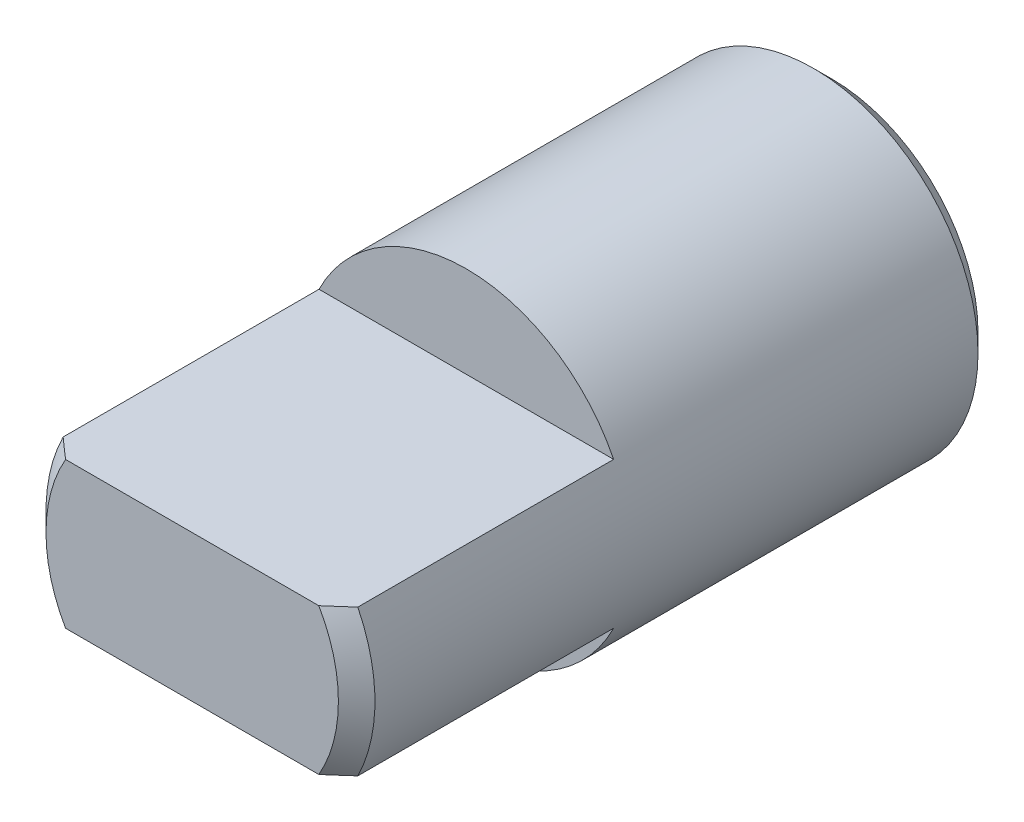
from build123d import *

# Parameters (mm, degrees)
ESQUISSE1_R                  = 9
EXTRUSION1_DEPTH             = 35
CHANFREIN1_SIZE              = 1
ENL_V_MAT_EXTRU_1_DEPTH      = 38.242448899
ENL_V_MAT_EXTRU_1_DEPTH_BACK = 38.242448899
ESQUISSE3_W                  = 15
ESQUISSE3_H                  = 5


with BuildPart() as part:
    # Esquisse1 → Extrusion1 (new body)
    with BuildSketch(Plane.XY):
        Circle(ESQUISSE1_R)
    extrude(amount=EXTRUSION1_DEPTH)

    # Chanfrein1
    chanfrein1_edges = [part.edges().sort_by_distance(p)[0] for p in [
        (-9, 0, 0),
        (-9, 0, 35),
    ]]
    chamfer(chanfrein1_edges, length=CHANFREIN1_SIZE)

    # Esquisse3 → Enl_v. mat.-Extru.1 (cut, two sides: drawn at the far end of the back side and taken through both)
    with BuildSketch(Plane(origin=(0, 0, 0), x_dir=(0, 0, -1), z_dir=(1, 0, 0)).offset(-ENL_V_MAT_EXTRU_1_DEPTH_BACK)):
        with Locations((-27.5, 6.5)):
            Rectangle(ESQUISSE3_W, ESQUISSE3_H)
        with Locations((-27.5, -6.5)):
            Rectangle(ESQUISSE3_W, ESQUISSE3_H)
    extrude(amount=ENL_V_MAT_EXTRU_1_DEPTH + ENL_V_MAT_EXTRU_1_DEPTH_BACK, mode=Mode.SUBTRACT)


solid = part.part
